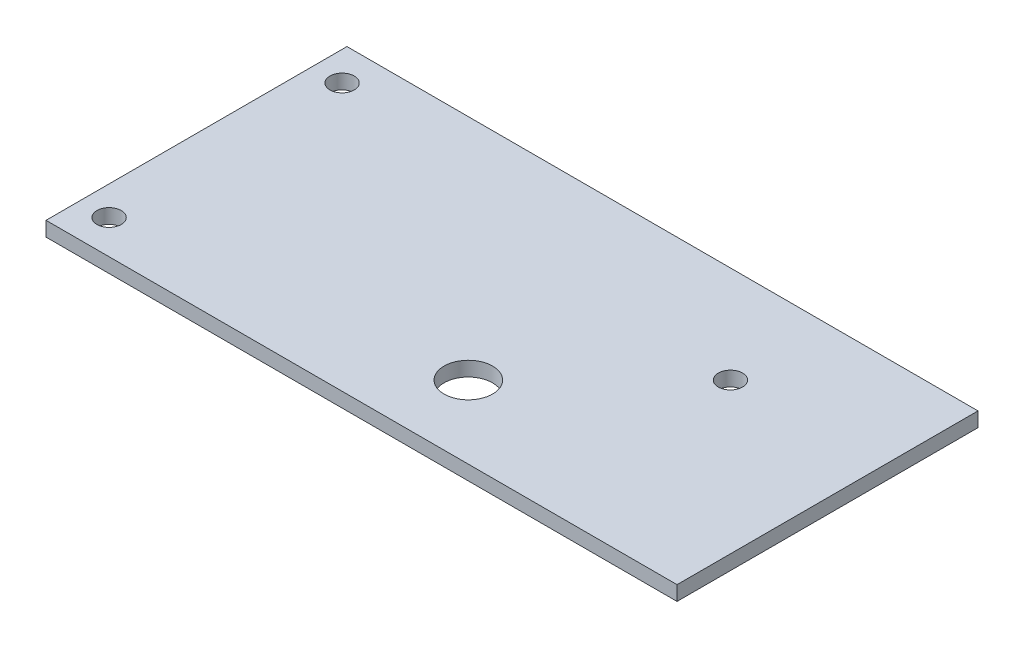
from build123d import *

# Parameters (mm, degrees)
SKETCH1_W         = 130
SKETCH1_H         = 62
SKETCH1_R         = 5
EXTRUDE1_DEPTH    = 3
M6_TAPPED_HOLE1_D = 5


with BuildPart() as part:
    # Sketch1 → Extrude1 (new body)
    with BuildSketch(Plane(origin=(0, 0, 0), x_dir=(1, 0, 0), z_dir=(0, 1, 0))):
        with Locations((65, 31)):
            Rectangle(SKETCH1_W, SKETCH1_H)
        with Locations(Location((72, 15, 0), (0, 0, 270))):
            Circle(SKETCH1_R, mode=Mode.SUBTRACT)
    extrude(amount=EXTRUDE1_DEPTH)

    # M6 Tapped Hole1 (through all)
    with Locations(Plane(origin=(6, 3, -55), x_dir=(0, 0, 1), z_dir=(0, 1, 0))):
        with Locations((0, 0), (48, 0), (13, 93)):
            Hole(M6_TAPPED_HOLE1_D / 2)


solid = part.part
